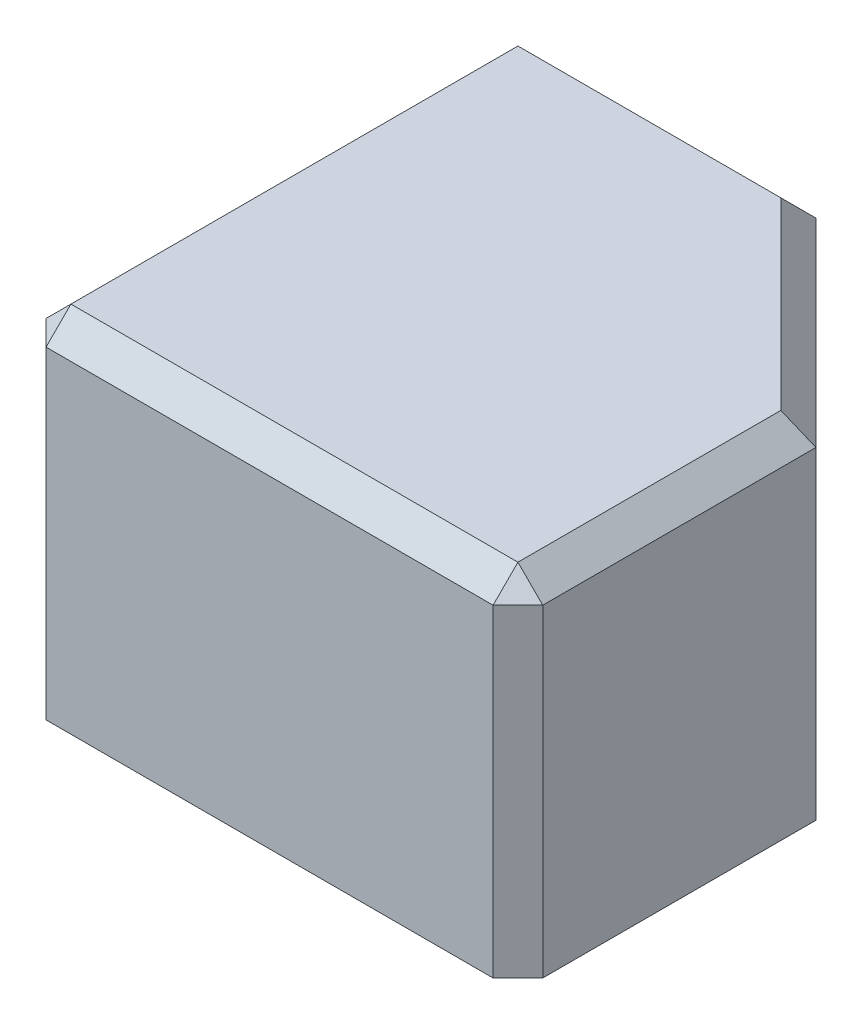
from build123d import *

# Parameters (mm, degrees)
BOSS_EXTRUDE1_DEPTH              = 7
F_1_65_1_65_DIAMETER_HOLE2_D     = 1.65
F_1_65_1_65_DIAMETER_HOLE2_DEPTH = 7
F_1_65_1_65_DIAMETER_HOLE2_TIP   = 0.825
F_1_65_1_65_DIAMETER_HOLE3_D     = 1.65
F_1_65_1_65_DIAMETER_HOLE3_DEPTH = 6.5
M1_6_TAPPED_HOLE1_D              = 1.25
M1_6_TAPPED_HOLE1_DEPTH          = 3.5
M1_6_TAPPED_HOLE1_TIP            = 0.375537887
CHAMFER1_SIZE                    = 0.5


with BuildPart() as part:
    # Sketch1 → Boss-Extrude1 (new body)
    with BuildSketch(Plane(origin=(0, 0, 0), x_dir=(1, 0, 0), z_dir=(0, 1, 0))):
        Polygon((0, 0), (0, 10), (6, 10), (10, 6), (10, 0), align=None)
    extrude(amount=BOSS_EXTRUDE1_DEPTH)

    # 1.65 _1.65_ Diameter Hole2
    with Locations(Plane(origin=(0, 0, -10), x_dir=(-1, 0, 0), z_dir=(0, 0, -1))):
        with Locations((-3, 5)):
            Hole(F_1_65_1_65_DIAMETER_HOLE2_D / 2, depth=F_1_65_1_65_DIAMETER_HOLE2_DEPTH)
            with Locations((0, 0, -(F_1_65_1_65_DIAMETER_HOLE2_DEPTH + F_1_65_1_65_DIAMETER_HOLE2_TIP / 2))):  # 90° drill point
                Cone(0, F_1_65_1_65_DIAMETER_HOLE2_D / 2, F_1_65_1_65_DIAMETER_HOLE2_TIP, mode=Mode.SUBTRACT)

    # 1.65 _1.65_ Diameter Hole3
    with Locations(Plane(origin=(8, 0, -8), x_dir=(-0.7071067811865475, 0, -0.7071067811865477), z_dir=(0.7071067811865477, 0, -0.7071067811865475))):
        with Locations((0, 5)):
            Hole(F_1_65_1_65_DIAMETER_HOLE3_D / 2, depth=F_1_65_1_65_DIAMETER_HOLE3_DEPTH)

    # M1.6 Tapped Hole1
    with Locations(Plane(origin=(0, 0, 0), x_dir=(-1, 0, 0), z_dir=(0, -1, 0))):
        with Locations((-5.1, 8), (-8, 5.1), (-2, 2)):
            Hole(M1_6_TAPPED_HOLE1_D / 2, depth=M1_6_TAPPED_HOLE1_DEPTH)
            with Locations((0, 0, -(M1_6_TAPPED_HOLE1_DEPTH + M1_6_TAPPED_HOLE1_TIP / 2))):  # 118° drill point
                Cone(0, M1_6_TAPPED_HOLE1_D / 2, M1_6_TAPPED_HOLE1_TIP, mode=Mode.SUBTRACT)

    # Chamfer1
    chamfer1_edges = [part.edges().sort_by_distance(p)[0] for p in [
        (8, 7, -8),
        (3, 7, -10),
        (0, 7, -5),
        (5, 7, 0),
        (10, 7, -3),
        (0, 3.5, 0),
        (0, 3.5, -10),
        (10, 3.5, 0),
    ]]
    chamfer(chamfer1_edges, length=CHAMFER1_SIZE)


solid = part.part
